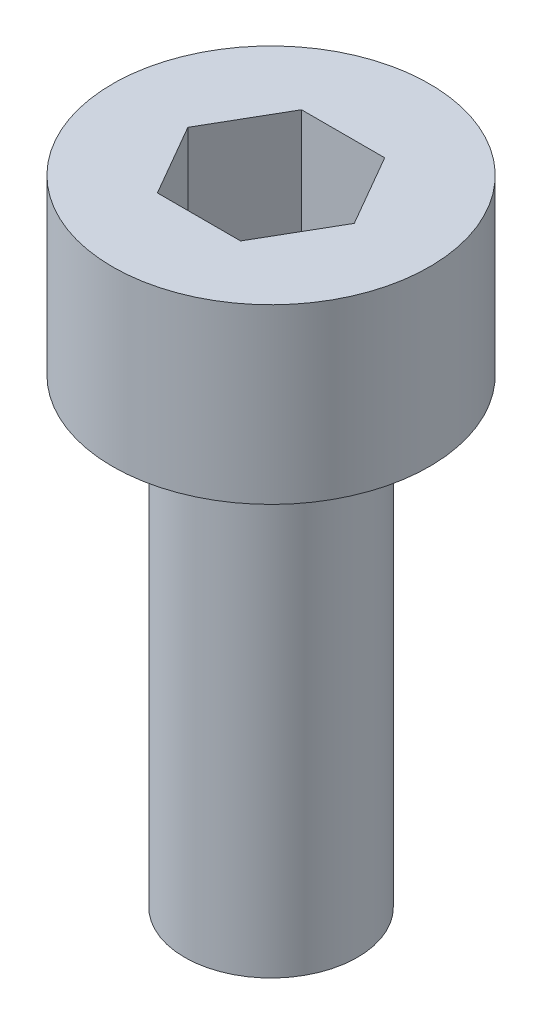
from build123d import *

# Parameters (mm, degrees)
CUT_EXTRUDE1_DEPTH = 2.5


with BuildPart() as part:
    # profiile → Base-Revolve (revolve)
    with BuildSketch(Plane.XY, mode=Mode.PRIVATE) as base_revolve_sk:
        Polygon((0, 3), (2.75, 3), (2.75, 0), (1.5, 0), (1.5, -8), (0, -8), align=None)
    revolve(base_revolve_sk.sketch.rotate(Axis((0, 9.907210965, 0), (0, -1, 0)), 90), axis=Axis((0, 9.907210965, 0), (0, -1, 0)))

    # Sketch1 → Cut-Extrude1 (cut)
    with BuildSketch(Plane(origin=(0, 3, 0), x_dir=(1, 0, 0), z_dir=(0, 1, 0))):
        Polygon((1.443375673, 0), (0.721687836, 1.25), (-0.721687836, 1.25), (-1.443375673, 0), (-0.721687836, -1.25), (0.721687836, -1.25), align=None)
    extrude(amount=-CUT_EXTRUDE1_DEPTH, mode=Mode.SUBTRACT)


solid = part.part
